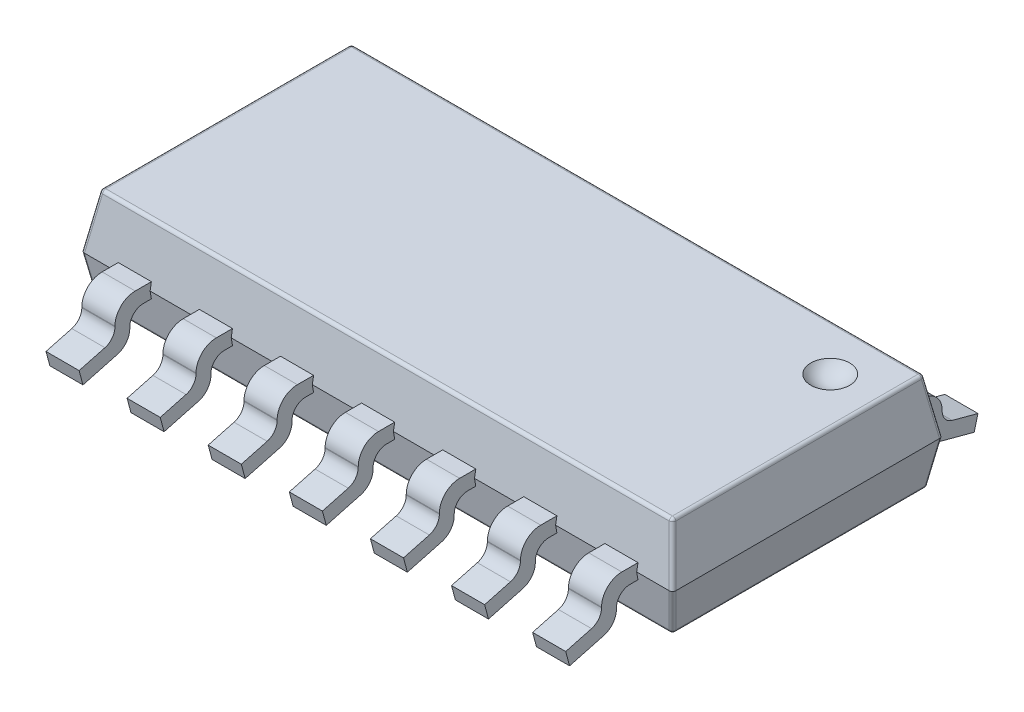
from build123d import *

# Parameters (mm, degrees)
BOSS_EXTRUDE1_DEPTH  = 4.375
CUT_EXTRUDE1_DEPTH   = 4.375
FILLET1_R            = 0.05
BOSS_EXTRUDE2_DEPTH  = 0.245
LPATTERN1_COUNT      = 4
LPATTERN1_PITCH      = 1.2
LPATTERN1_COL_COUNT  = 4
LPATTERN1_COL_PITCH  = 1.2
MIRROR1_COPY_1_DEPTH = 0.245
MIRROR1_COPY_2_DEPTH = 0.245
MIRROR1_COPY_3_DEPTH = 0.245
MIRROR1_COPY_4_DEPTH = 0.245
MIRROR1_COPY_5_DEPTH = 0.245
MIRROR1_COPY_6_DEPTH = 0.245


with BuildPart() as part:
    # Sketch3 → Boss-Extrude1 (new, symmetric)
    with BuildSketch(Plane(origin=(0, 0, 0), x_dir=(0, 0, -1), z_dir=(1, 0, 0))):
        Polygon((-2, 0), (-1.885387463, -0.65), (1.885387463, -0.65), (2, 0), (1.858938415, 0.8), (-1.858938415, 0.8), align=None)
    extrude(amount=BOSS_EXTRUDE1_DEPTH, both=True)

    # Sketch4 → Cut-Extrude1 (cut, symmetric)
    with BuildSketch(Plane.XY):
        Polygon((-4.375, 0), (-4.233938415, 0.8), (-4.741857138, 0.8), (-4.741857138, -0.65), (-4.260387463, -0.65), align=None)
        Polygon((4.741857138, -0.65), (4.741857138, 0.8), (4.233938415, 0.8), (4.375, 0), (4.260387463, -0.65), align=None)
    extrude(amount=CUT_EXTRUDE1_DEPTH, both=True, mode=Mode.SUBTRACT)

    # Fillet1
    fillet1_edges = [part.edges().sort_by_distance(p)[0] for p in [
        (0, -0.65, -1.885387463),
        (0, -0.65, 1.885387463),
        (0, 0.8, 1.858938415),
        (0, 0.8, -1.858938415),
        (-4.317693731, -0.325, 1.942693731),
        (-4.317693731, -0.325, -1.942693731),
        (-4.260387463, -0.65, 0),
        (-4.304469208, 0.4, -1.929469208),
        (-4.233938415, 0.8, 0),
        (-4.304469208, 0.4, 1.929469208),
        (4.260387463, -0.65, 0),
        (4.317693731, -0.325, 1.942693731),
        (4.317693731, -0.325, -1.942693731),
        (4.304469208, 0.4, -1.929469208),
        (4.304469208, 0.4, 1.929469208),
        (4.233938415, 0.8, 0),
    ]]
    fillet(fillet1_edges, radius=FILLET1_R)

    # Sketch5 → Boss-Extrude2 (add, symmetric)
    with BuildSketch(Plane(origin=(0, 0, 0), x_dir=(0, 0, -1), z_dir=(1, 0, 0))):
        with BuildLine():
            Line((-1.980604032, 0.11), (-2, 0))
            Line((-2, 0), (-1.980604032, -0.11))
            Line((-1.980604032, -0.11), (-2.1, -0.11))
            ThreePointArc((-2.1, -0.11), (-2.241421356, -0.168578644), (-2.3, -0.31))
            Line((-2.3, -0.31), (-2.3, -0.329218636))
            ThreePointArc((-2.3, -0.329218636), (-2.351661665, -0.481408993), (-2.485295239, -0.570700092))
            Line((-2.485295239, -0.570700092), (-2.99305981, -0.706755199))
            Line((-2.99305981, -0.706755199), (-3.05, -0.494251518))
            Line((-3.05, -0.494251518), (-2.668236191, -0.391958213))
            ThreePointArc((-2.668236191, -0.391958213), (-2.561329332, -0.320525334), (-2.52, -0.198773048))
            Line((-2.52, -0.198773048), (-2.52, -0.19))
            ThreePointArc((-2.52, -0.19), (-2.432132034, 0.022132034), (-2.22, 0.11))
            Line((-2.22, 0.11), (-2.180725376, 0.11))
            Line((-2.180725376, 0.11), (-1.980604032, 0.11))
        make_face()
    boss_extrude2 = extrude(amount=BOSS_EXTRUDE2_DEPTH, both=True)

    # LPattern1: Boss-Extrude2 ×4
    with Locations(*[(i * LPATTERN1_PITCH, 0, 0) for i in range(1, LPATTERN1_COUNT)]):
        add(boss_extrude2)

    # LPattern1 col: Boss-Extrude2 ×4
    with Locations(*[(-i * LPATTERN1_COL_PITCH, 0, 0) for i in range(1, LPATTERN1_COL_COUNT)]):
        add(boss_extrude2)

    # Mirror1: Boss-Extrude2 across plane
    add(boss_extrude2.mirror(Plane.XY))

    # Mirror1 copy 1 sketch → Mirror1 copy 1 (add, symmetric)
    with BuildSketch(Plane(origin=(1.2, 0, 0), x_dir=(0, 0, 1), z_dir=(1, 0, 0))):
        with BuildLine():
            Line((-1.980604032, -0.11), (-2, 0))
            Line((-2, 0), (-1.980604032, 0.11))
            Line((-1.980604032, 0.11), (-2.1, 0.11))
            ThreePointArc((-2.1, 0.11), (-2.241421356, 0.168578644), (-2.3, 0.31))
            Line((-2.3, 0.31), (-2.3, 0.329218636))
            ThreePointArc((-2.3, 0.329218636), (-2.351661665, 0.481408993), (-2.485295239, 0.570700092))
            Line((-2.485295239, 0.570700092), (-2.99305981, 0.706755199))
            Line((-2.99305981, 0.706755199), (-3.05, 0.494251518))
            Line((-3.05, 0.494251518), (-2.668236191, 0.391958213))
            ThreePointArc((-2.668236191, 0.391958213), (-2.561329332, 0.320525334), (-2.52, 0.198773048))
            Line((-2.52, 0.198773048), (-2.52, 0.19))
            ThreePointArc((-2.52, 0.19), (-2.432132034, -0.022132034), (-2.22, -0.11))
            Line((-2.22, -0.11), (-2.180725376, -0.11))
            Line((-2.180725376, -0.11), (-1.980604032, -0.11))
        make_face()
    extrude(amount=MIRROR1_COPY_1_DEPTH, both=True)

    # Mirror1 copy 2 sketch → Mirror1 copy 2 (add, symmetric)
    with BuildSketch(Plane(origin=(2.4, 0, 0), x_dir=(0, 0, 1), z_dir=(1, 0, 0))):
        with BuildLine():
            Line((-1.980604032, -0.11), (-2, 0))
            Line((-2, 0), (-1.980604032, 0.11))
            Line((-1.980604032, 0.11), (-2.1, 0.11))
            ThreePointArc((-2.1, 0.11), (-2.241421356, 0.168578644), (-2.3, 0.31))
            Line((-2.3, 0.31), (-2.3, 0.329218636))
            ThreePointArc((-2.3, 0.329218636), (-2.351661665, 0.481408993), (-2.485295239, 0.570700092))
            Line((-2.485295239, 0.570700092), (-2.99305981, 0.706755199))
            Line((-2.99305981, 0.706755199), (-3.05, 0.494251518))
            Line((-3.05, 0.494251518), (-2.668236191, 0.391958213))
            ThreePointArc((-2.668236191, 0.391958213), (-2.561329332, 0.320525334), (-2.52, 0.198773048))
            Line((-2.52, 0.198773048), (-2.52, 0.19))
            ThreePointArc((-2.52, 0.19), (-2.432132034, -0.022132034), (-2.22, -0.11))
            Line((-2.22, -0.11), (-2.180725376, -0.11))
            Line((-2.180725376, -0.11), (-1.980604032, -0.11))
        make_face()
    extrude(amount=MIRROR1_COPY_2_DEPTH, both=True)

    # Mirror1 copy 3 sketch → Mirror1 copy 3 (add, symmetric)
    with BuildSketch(Plane(origin=(3.6, 0, 0), x_dir=(0, 0, 1), z_dir=(1, 0, 0))):
        with BuildLine():
            Line((-1.980604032, -0.11), (-2, 0))
            Line((-2, 0), (-1.980604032, 0.11))
            Line((-1.980604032, 0.11), (-2.1, 0.11))
            ThreePointArc((-2.1, 0.11), (-2.241421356, 0.168578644), (-2.3, 0.31))
            Line((-2.3, 0.31), (-2.3, 0.329218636))
            ThreePointArc((-2.3, 0.329218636), (-2.351661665, 0.481408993), (-2.485295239, 0.570700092))
            Line((-2.485295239, 0.570700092), (-2.99305981, 0.706755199))
            Line((-2.99305981, 0.706755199), (-3.05, 0.494251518))
            Line((-3.05, 0.494251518), (-2.668236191, 0.391958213))
            ThreePointArc((-2.668236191, 0.391958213), (-2.561329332, 0.320525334), (-2.52, 0.198773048))
            Line((-2.52, 0.198773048), (-2.52, 0.19))
            ThreePointArc((-2.52, 0.19), (-2.432132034, -0.022132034), (-2.22, -0.11))
            Line((-2.22, -0.11), (-2.180725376, -0.11))
            Line((-2.180725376, -0.11), (-1.980604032, -0.11))
        make_face()
    extrude(amount=MIRROR1_COPY_3_DEPTH, both=True)

    # Mirror1 copy 4 sketch → Mirror1 copy 4 (add, symmetric)
    with BuildSketch(Plane(origin=(-1.2, 0, 0), x_dir=(0, 0, 1), z_dir=(1, 0, 0))):
        with BuildLine():
            Line((-1.980604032, -0.11), (-2, 0))
            Line((-2, 0), (-1.980604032, 0.11))
            Line((-1.980604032, 0.11), (-2.1, 0.11))
            ThreePointArc((-2.1, 0.11), (-2.241421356, 0.168578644), (-2.3, 0.31))
            Line((-2.3, 0.31), (-2.3, 0.329218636))
            ThreePointArc((-2.3, 0.329218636), (-2.351661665, 0.481408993), (-2.485295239, 0.570700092))
            Line((-2.485295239, 0.570700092), (-2.99305981, 0.706755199))
            Line((-2.99305981, 0.706755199), (-3.05, 0.494251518))
            Line((-3.05, 0.494251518), (-2.668236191, 0.391958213))
            ThreePointArc((-2.668236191, 0.391958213), (-2.561329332, 0.320525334), (-2.52, 0.198773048))
            Line((-2.52, 0.198773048), (-2.52, 0.19))
            ThreePointArc((-2.52, 0.19), (-2.432132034, -0.022132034), (-2.22, -0.11))
            Line((-2.22, -0.11), (-2.180725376, -0.11))
            Line((-2.180725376, -0.11), (-1.980604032, -0.11))
        make_face()
    extrude(amount=MIRROR1_COPY_4_DEPTH, both=True)

    # Mirror1 copy 5 sketch → Mirror1 copy 5 (add, symmetric)
    with BuildSketch(Plane(origin=(-2.4, 0, 0), x_dir=(0, 0, 1), z_dir=(1, 0, 0))):
        with BuildLine():
            Line((-1.980604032, -0.11), (-2, 0))
            Line((-2, 0), (-1.980604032, 0.11))
            Line((-1.980604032, 0.11), (-2.1, 0.11))
            ThreePointArc((-2.1, 0.11), (-2.241421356, 0.168578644), (-2.3, 0.31))
            Line((-2.3, 0.31), (-2.3, 0.329218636))
            ThreePointArc((-2.3, 0.329218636), (-2.351661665, 0.481408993), (-2.485295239, 0.570700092))
            Line((-2.485295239, 0.570700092), (-2.99305981, 0.706755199))
            Line((-2.99305981, 0.706755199), (-3.05, 0.494251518))
            Line((-3.05, 0.494251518), (-2.668236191, 0.391958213))
            ThreePointArc((-2.668236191, 0.391958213), (-2.561329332, 0.320525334), (-2.52, 0.198773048))
            Line((-2.52, 0.198773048), (-2.52, 0.19))
            ThreePointArc((-2.52, 0.19), (-2.432132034, -0.022132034), (-2.22, -0.11))
            Line((-2.22, -0.11), (-2.180725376, -0.11))
            Line((-2.180725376, -0.11), (-1.980604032, -0.11))
        make_face()
    extrude(amount=MIRROR1_COPY_5_DEPTH, both=True)

    # Mirror1 copy 6 sketch → Mirror1 copy 6 (add, symmetric)
    with BuildSketch(Plane(origin=(-3.6, 0, 0), x_dir=(0, 0, 1), z_dir=(1, 0, 0))):
        with BuildLine():
            Line((-1.980604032, -0.11), (-2, 0))
            Line((-2, 0), (-1.980604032, 0.11))
            Line((-1.980604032, 0.11), (-2.1, 0.11))
            ThreePointArc((-2.1, 0.11), (-2.241421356, 0.168578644), (-2.3, 0.31))
            Line((-2.3, 0.31), (-2.3, 0.329218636))
            ThreePointArc((-2.3, 0.329218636), (-2.351661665, 0.481408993), (-2.485295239, 0.570700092))
            Line((-2.485295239, 0.570700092), (-2.99305981, 0.706755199))
            Line((-2.99305981, 0.706755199), (-3.05, 0.494251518))
            Line((-3.05, 0.494251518), (-2.668236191, 0.391958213))
            ThreePointArc((-2.668236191, 0.391958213), (-2.561329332, 0.320525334), (-2.52, 0.198773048))
            Line((-2.52, 0.198773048), (-2.52, 0.19))
            ThreePointArc((-2.52, 0.19), (-2.432132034, -0.022132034), (-2.22, -0.11))
            Line((-2.22, -0.11), (-2.180725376, -0.11))
            Line((-2.180725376, -0.11), (-1.980604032, -0.11))
        make_face()
    extrude(amount=MIRROR1_COPY_6_DEPTH, both=True)

    # Sketch6 → Cut-Revolve1 (revolve, cut)
    with BuildSketch(Plane(origin=(0, 1, 0), x_dir=(1, 0, 0), z_dir=(0, 1, 0))):
        with BuildLine():
            Line((3.191983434, 1.166983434), (3.891983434, 1.166983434))
            ThreePointArc((3.891983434, 1.166983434), (3.541983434, 1.516983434), (3.191983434, 1.166983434))
        make_face()
    revolve(axis=Axis((3.191983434, 1, -1.166983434), (1, 0, 0)), mode=Mode.SUBTRACT)


solid = part.part
